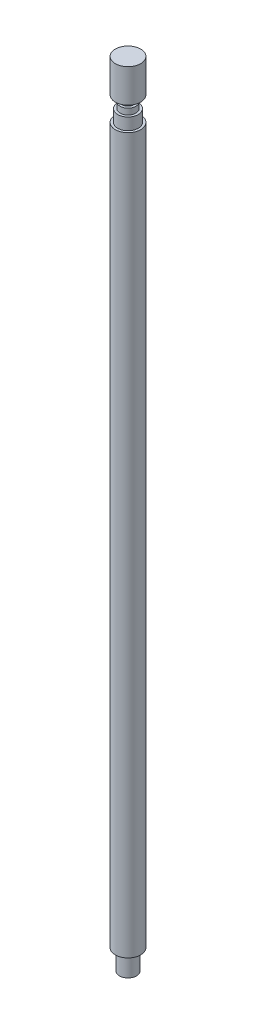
ISO-10303-21;
HEADER;
FILE_DESCRIPTION(('STEP AP214'),'2;1');
FILE_NAME('part.step','',(''),(''),'','','');
FILE_SCHEMA(('AUTOMOTIVE_DESIGN { 1 0 10303 214 1 1 1 1 }'));
ENDSEC;
DATA;
#1=APPLICATION_CONTEXT('core data for automotive mechanical design processes');
#2=APPLICATION_PROTOCOL_DEFINITION('international standard','automotive_design',2000,#1);
#3=PRODUCT_CONTEXT('',#1,'mechanical');
#4=PRODUCT('Part','Part','',(#3));
#5=PRODUCT_RELATED_PRODUCT_CATEGORY('part','',(#4));
#6=PRODUCT_DEFINITION_FORMATION('','',#4);
#7=PRODUCT_DEFINITION_CONTEXT('part definition',#1,'design');
#8=PRODUCT_DEFINITION('design','',#6,#7);
#9=PRODUCT_DEFINITION_SHAPE('','',#8);
#10=(LENGTH_UNIT() NAMED_UNIT(*) SI_UNIT(.MILLI.,.METRE.));
#11=(NAMED_UNIT(*) PLANE_ANGLE_UNIT() SI_UNIT($,.RADIAN.));
#12=(NAMED_UNIT(*) SI_UNIT($,.STERADIAN.) SOLID_ANGLE_UNIT());
#13=UNCERTAINTY_MEASURE_WITH_UNIT(LENGTH_MEASURE(1.E-05),#10,'distance_accuracy_value','');
#14=(GEOMETRIC_REPRESENTATION_CONTEXT(3) GLOBAL_UNCERTAINTY_ASSIGNED_CONTEXT((#13)) GLOBAL_UNIT_ASSIGNED_CONTEXT((#10,
#11,#12)) REPRESENTATION_CONTEXT('',''));
#15=CARTESIAN_POINT('',(0.,0.,0.));
#16=DIRECTION('',(0.,0.,1.));
#17=DIRECTION('',(1.,0.,0.));
#18=AXIS2_PLACEMENT_3D('',#15,#16,#17);
#19=CARTESIAN_POINT('',(0.,0.,0.));
#20=DIRECTION('',(0.,1.,0.));
#21=DIRECTION('',(0.,0.,1.));
#22=AXIS2_PLACEMENT_3D('',#19,#20,#21);
#23=PLANE('',#22);
#24=CARTESIAN_POINT('',(0.,0.,0.));
#25=DIRECTION('',(0.,1.,0.));
#26=DIRECTION('',(0.,0.,1.));
#27=AXIS2_PLACEMENT_3D('',#24,#25,#26);
#28=CIRCLE('',#27,2.125);
#29=CARTESIAN_POINT('',(0.,0.,2.125));
#30=VERTEX_POINT('',#29);
#31=EDGE_CURVE('E39',#30,#30,#28,.T.);
#32=ORIENTED_EDGE('',*,*,#31,.F.);
#33=EDGE_LOOP('',(#32));
#34=FACE_BOUND('',#33,.T.);
#35=CARTESIAN_POINT('',(0.,0.,0.));
#36=DIRECTION('',(0.,1.,0.));
#37=DIRECTION('',(0.,0.,1.));
#38=AXIS2_PLACEMENT_3D('',#35,#36,#37);
#39=CIRCLE('',#38,1.435);
#40=CARTESIAN_POINT('',(0.,0.,1.435));
#41=VERTEX_POINT('',#40);
#42=EDGE_CURVE('E10',#41,#41,#39,.F.);
#43=ORIENTED_EDGE('',*,*,#42,.F.);
#44=EDGE_LOOP('',(#43));
#45=FACE_BOUND('',#44,.T.);
#46=ADVANCED_FACE('F24',(#34,#45),#23,.F.);
#47=CARTESIAN_POINT('',(0.,129.6,0.));
#48=DIRECTION('',(0.,-1.,0.));
#49=DIRECTION('',(0.,0.,-1.));
#50=AXIS2_PLACEMENT_3D('',#47,#48,#49);
#51=CYLINDRICAL_SURFACE('',#50,0.925);
#52=CARTESIAN_POINT('',(0.,123.,0.));
#53=DIRECTION('',(0.,1.,0.));
#54=DIRECTION('',(0.,0.,1.));
#55=AXIS2_PLACEMENT_3D('',#52,#53,#54);
#56=CIRCLE('',#55,0.925);
#57=CARTESIAN_POINT('',(0.,123.,0.925));
#58=VERTEX_POINT('',#57);
#59=EDGE_CURVE('E56',#58,#58,#56,.T.);
#60=ORIENTED_EDGE('',*,*,#59,.T.);
#61=EDGE_LOOP('',(#60));
#62=FACE_BOUND('',#61,.T.);
#63=CARTESIAN_POINT('',(0.,124.,0.));
#64=DIRECTION('',(0.,1.,0.));
#65=DIRECTION('',(0.,0.,1.));
#66=AXIS2_PLACEMENT_3D('',#63,#64,#65);
#67=CIRCLE('',#66,0.925);
#68=CARTESIAN_POINT('',(0.,124.,0.925));
#69=VERTEX_POINT('',#68);
#70=EDGE_CURVE('E31',#69,#69,#67,.T.);
#71=ORIENTED_EDGE('',*,*,#70,.F.);
#72=EDGE_LOOP('',(#71));
#73=FACE_BOUND('',#72,.T.);
#74=ADVANCED_FACE('F85',(#62,#73),#51,.T.);
#75=CARTESIAN_POINT('',(0.,123.,0.));
#76=DIRECTION('',(0.,1.,0.));
#77=DIRECTION('',(0.,0.,1.));
#78=AXIS2_PLACEMENT_3D('',#75,#76,#77);
#79=PLANE('',#78);
#80=CARTESIAN_POINT('',(0.,123.,0.));
#81=DIRECTION('',(0.,1.,0.));
#82=DIRECTION('',(0.,0.,1.));
#83=AXIS2_PLACEMENT_3D('',#80,#81,#82);
#84=CIRCLE('',#83,1.325);
#85=CARTESIAN_POINT('',(0.,123.,1.325));
#86=VERTEX_POINT('',#85);
#87=EDGE_CURVE('E50',#86,#86,#84,.T.);
#88=ORIENTED_EDGE('',*,*,#87,.T.);
#89=EDGE_LOOP('',(#88));
#90=FACE_BOUND('',#89,.T.);
#91=ORIENTED_EDGE('',*,*,#59,.F.);
#92=EDGE_LOOP('',(#91));
#93=FACE_BOUND('',#92,.T.);
#94=ADVANCED_FACE('F91',(#90,#93),#79,.T.);
#95=CARTESIAN_POINT('',(0.,122.,0.));
#96=DIRECTION('',(0.,1.,0.));
#97=DIRECTION('',(0.,0.,1.));
#98=AXIS2_PLACEMENT_3D('',#95,#96,#97);
#99=PLANE('',#98);
#100=CARTESIAN_POINT('',(0.,122.,0.));
#101=DIRECTION('',(0.,1.,0.));
#102=DIRECTION('',(0.,0.,1.));
#103=AXIS2_PLACEMENT_3D('',#100,#101,#102);
#104=CIRCLE('',#103,1.725);
#105=CARTESIAN_POINT('',(0.,122.,1.725));
#106=VERTEX_POINT('',#105);
#107=EDGE_CURVE('E44',#106,#106,#104,.T.);
#108=ORIENTED_EDGE('',*,*,#107,.T.);
#109=EDGE_LOOP('',(#108));
#110=FACE_BOUND('',#109,.T.);
#111=CARTESIAN_POINT('',(0.,122.,0.));
#112=DIRECTION('',(0.,1.,0.));
#113=DIRECTION('',(0.,0.,1.));
#114=AXIS2_PLACEMENT_3D('',#111,#112,#113);
#115=CIRCLE('',#114,1.325);
#116=CARTESIAN_POINT('',(0.,122.,1.325));
#117=VERTEX_POINT('',#116);
#118=EDGE_CURVE('E53',#117,#117,#115,.T.);
#119=ORIENTED_EDGE('',*,*,#118,.F.);
#120=EDGE_LOOP('',(#119));
#121=FACE_BOUND('',#120,.T.);
#122=ADVANCED_FACE('F101',(#110,#121),#99,.T.);
#123=CARTESIAN_POINT('',(0.,120.,0.));
#124=DIRECTION('',(0.,1.,0.));
#125=DIRECTION('',(0.,0.,1.));
#126=AXIS2_PLACEMENT_3D('',#123,#124,#125);
#127=PLANE('',#126);
#128=CARTESIAN_POINT('',(0.,120.,0.));
#129=DIRECTION('',(0.,1.,0.));
#130=DIRECTION('',(0.,0.,1.));
#131=AXIS2_PLACEMENT_3D('',#128,#129,#130);
#132=CIRCLE('',#131,2.125);
#133=CARTESIAN_POINT('',(0.,120.,2.125));
#134=VERTEX_POINT('',#133);
#135=EDGE_CURVE('E35',#134,#134,#132,.T.);
#136=ORIENTED_EDGE('',*,*,#135,.T.);
#137=EDGE_LOOP('',(#136));
#138=FACE_BOUND('',#137,.T.);
#139=CARTESIAN_POINT('',(0.,120.,0.));
#140=DIRECTION('',(0.,1.,0.));
#141=DIRECTION('',(0.,0.,1.));
#142=AXIS2_PLACEMENT_3D('',#139,#140,#141);
#143=CIRCLE('',#142,1.725);
#144=CARTESIAN_POINT('',(0.,120.,1.725));
#145=VERTEX_POINT('',#144);
#146=EDGE_CURVE('E47',#145,#145,#143,.T.);
#147=ORIENTED_EDGE('',*,*,#146,.F.);
#148=EDGE_LOOP('',(#147));
#149=FACE_BOUND('',#148,.T.);
#150=ADVANCED_FACE('F99',(#138,#149),#127,.T.);
#151=CARTESIAN_POINT('',(0.,120.,0.));
#152=DIRECTION('',(0.,-1.,0.));
#153=DIRECTION('',(0.,0.,-1.));
#154=AXIS2_PLACEMENT_3D('',#151,#152,#153);
#155=CYLINDRICAL_SURFACE('',#154,2.125);
#156=ORIENTED_EDGE('',*,*,#135,.F.);
#157=EDGE_LOOP('',(#156));
#158=FACE_BOUND('',#157,.T.);
#159=ORIENTED_EDGE('',*,*,#31,.T.);
#160=EDGE_LOOP('',(#159));
#161=FACE_BOUND('',#160,.T.);
#162=ADVANCED_FACE('F26',(#158,#161),#155,.T.);
#163=CARTESIAN_POINT('',(0.,122.,0.));
#164=DIRECTION('',(0.,-1.,0.));
#165=DIRECTION('',(0.,0.,-1.));
#166=AXIS2_PLACEMENT_3D('',#163,#164,#165);
#167=CYLINDRICAL_SURFACE('',#166,1.725);
#168=ORIENTED_EDGE('',*,*,#107,.F.);
#169=EDGE_LOOP('',(#168));
#170=FACE_BOUND('',#169,.T.);
#171=ORIENTED_EDGE('',*,*,#146,.T.);
#172=EDGE_LOOP('',(#171));
#173=FACE_BOUND('',#172,.T.);
#174=ADVANCED_FACE('F97',(#170,#173),#167,.T.);
#175=CARTESIAN_POINT('',(0.,123.,0.));
#176=DIRECTION('',(0.,-1.,0.));
#177=DIRECTION('',(0.,0.,-1.));
#178=AXIS2_PLACEMENT_3D('',#175,#176,#177);
#179=CYLINDRICAL_SURFACE('',#178,1.325);
#180=ORIENTED_EDGE('',*,*,#87,.F.);
#181=EDGE_LOOP('',(#180));
#182=FACE_BOUND('',#181,.T.);
#183=ORIENTED_EDGE('',*,*,#118,.T.);
#184=EDGE_LOOP('',(#183));
#185=FACE_BOUND('',#184,.T.);
#186=ADVANCED_FACE('F114',(#182,#185),#179,.T.);
#187=CARTESIAN_POINT('',(0.,124.,0.));
#188=DIRECTION('',(0.,1.,0.));
#189=DIRECTION('',(0.,0.,1.));
#190=AXIS2_PLACEMENT_3D('',#187,#188,#189);
#191=PLANE('',#190);
#192=CARTESIAN_POINT('',(0.,124.,0.));
#193=DIRECTION('',(0.,1.,0.));
#194=DIRECTION('',(0.,0.,1.));
#195=AXIS2_PLACEMENT_3D('',#192,#193,#194);
#196=CIRCLE('',#195,2.125);
#197=CARTESIAN_POINT('',(0.,124.,2.125));
#198=VERTEX_POINT('',#197);
#199=EDGE_CURVE('E59',#198,#198,#196,.T.);
#200=ORIENTED_EDGE('',*,*,#199,.F.);
#201=EDGE_LOOP('',(#200));
#202=FACE_BOUND('',#201,.T.);
#203=ORIENTED_EDGE('',*,*,#70,.T.);
#204=EDGE_LOOP('',(#203));
#205=FACE_BOUND('',#204,.T.);
#206=ADVANCED_FACE('F119',(#202,#205),#191,.F.);
#207=CARTESIAN_POINT('',(0.,124.,0.));
#208=DIRECTION('',(0.,1.,0.));
#209=DIRECTION('',(0.,0.,1.));
#210=AXIS2_PLACEMENT_3D('',#207,#208,#209);
#211=CYLINDRICAL_SURFACE('',#210,2.125);
#212=ORIENTED_EDGE('',*,*,#199,.T.);
#213=EDGE_LOOP('',(#212));
#214=FACE_BOUND('',#213,.T.);
#215=CARTESIAN_POINT('',(0.,129.6,0.));
#216=DIRECTION('',(0.,1.,0.));
#217=DIRECTION('',(0.,0.,1.));
#218=AXIS2_PLACEMENT_3D('',#215,#216,#217);
#219=CIRCLE('',#218,2.125);
#220=CARTESIAN_POINT('',(0.,129.6,2.125));
#221=VERTEX_POINT('',#220);
#222=EDGE_CURVE('E62',#221,#221,#219,.T.);
#223=ORIENTED_EDGE('',*,*,#222,.F.);
#224=EDGE_LOOP('',(#223));
#225=FACE_BOUND('',#224,.T.);
#226=ADVANCED_FACE('F81',(#214,#225),#211,.T.);
#227=CARTESIAN_POINT('',(0.,129.6,0.));
#228=DIRECTION('',(0.,1.,0.));
#229=DIRECTION('',(0.,0.,1.));
#230=AXIS2_PLACEMENT_3D('',#227,#228,#229);
#231=PLANE('',#230);
#232=ORIENTED_EDGE('',*,*,#222,.T.);
#233=EDGE_LOOP('',(#232));
#234=FACE_BOUND('',#233,.T.);
#235=ADVANCED_FACE('F73',(#234),#231,.T.);
#236=CARTESIAN_POINT('',(0.,-3.4,0.));
#237=DIRECTION('',(0.,1.,0.));
#238=DIRECTION('',(0.,0.,1.));
#239=AXIS2_PLACEMENT_3D('',#236,#237,#238);
#240=CYLINDRICAL_SURFACE('',#239,1.435);
#241=CARTESIAN_POINT('',(0.,-3.4,0.));
#242=DIRECTION('',(0.,-1.,0.));
#243=DIRECTION('',(0.,0.,-1.));
#244=AXIS2_PLACEMENT_3D('',#241,#242,#243);
#245=CIRCLE('',#244,1.435);
#246=CARTESIAN_POINT('',(0.,-3.4,-1.435));
#247=VERTEX_POINT('',#246);
#248=EDGE_CURVE('E65',#247,#247,#245,.T.);
#249=ORIENTED_EDGE('',*,*,#248,.F.);
#250=EDGE_LOOP('',(#249));
#251=FACE_BOUND('',#250,.T.);
#252=ORIENTED_EDGE('',*,*,#42,.T.);
#253=EDGE_LOOP('',(#252));
#254=FACE_BOUND('',#253,.T.);
#255=ADVANCED_FACE('F71',(#251,#254),#240,.T.);
#256=CARTESIAN_POINT('',(0.,-3.4,0.));
#257=DIRECTION('',(0.,-1.,0.));
#258=DIRECTION('',(0.,0.,-1.));
#259=AXIS2_PLACEMENT_3D('',#256,#257,#258);
#260=PLANE('',#259);
#261=ORIENTED_EDGE('',*,*,#248,.T.);
#262=EDGE_LOOP('',(#261));
#263=FACE_BOUND('',#262,.T.);
#264=ADVANCED_FACE('F69',(#263),#260,.T.);
#265=CLOSED_SHELL('',(#46,#74,#94,#122,#150,#162,#174,#186,#206,#226,#235,#255,#264));
#266=MANIFOLD_SOLID_BREP('B2',#265);
#267=ADVANCED_BREP_SHAPE_REPRESENTATION('',(#18,#266),#14);
#268=SHAPE_DEFINITION_REPRESENTATION(#9,#267);
ENDSEC;
END-ISO-10303-21;
